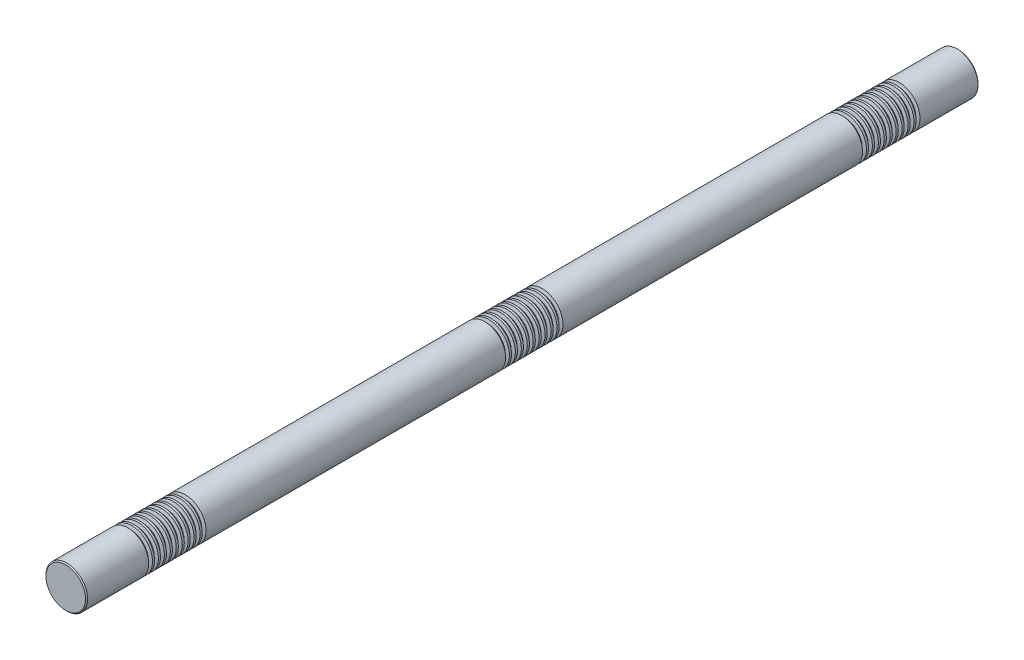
from build123d import *

# Parameters (mm, degrees)
SKETCH1_R           = 35
BOSS_EXTRUDE1_DEPTH = 750
CHAMFER1_SIZE       = 1.75
LPATTERN1_COUNT     = 10
LPATTERN1_PITCH     = 10
LPATTERN2_COUNT     = 3
LPATTERN2_PITCH     = 600


with BuildPart() as part:
    # Sketch1 → Boss-Extrude1 (new, symmetric)
    with BuildSketch(Plane.XY):
        Circle(SKETCH1_R)
    extrude(amount=BOSS_EXTRUDE1_DEPTH, both=True)

    # Chamfer1
    chamfer1_edges = [part.edges().sort_by_distance(p)[0] for p in [
        (-35, 0, -750),
        (-35, 0, 750),
    ]]
    chamfer(chamfer1_edges, length=CHAMFER1_SIZE)

    # Sketch2 → Cut-Revolve1 (revolve, cut)
    with BuildSketch(Plane(origin=(0, 0, 0), x_dir=(0, 0, -1), z_dir=(1, 0, 0)), mode=Mode.PRIVATE) as cut_revolve1_sk:
        Polygon((650.736860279, 35), (644.263139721, 35), (645.736860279, 29.5), (649.263139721, 29.5), align=None)
    cut_revolve1 = revolve(cut_revolve1_sk.sketch.rotate(Axis((0, 0, 750), (0, 0, -1)), 90), axis=Axis((0, 0, 750), (0, 0, -1)), mode=Mode.SUBTRACT)

    # LPattern1: Cut-Revolve1 ×10
    with Locations(*[(0, 0, i * LPATTERN1_PITCH) for i in range(1, LPATTERN1_COUNT)]):
        add(cut_revolve1, mode=Mode.SUBTRACT)

    # LPattern2: Cut-Revolve1 ×3
    with Locations(*[(0, 0, i * LPATTERN2_PITCH) for i in range(1, LPATTERN2_COUNT)]):
        add(cut_revolve1, mode=Mode.SUBTRACT)

    # LPattern2 copy 1 sketch → LPattern2 copy 1 (revolve, cut)
    with BuildSketch(Plane(origin=(0, 0, 610), x_dir=(0, 0, -1), z_dir=(1, 0, 0))):
        Polygon((650.736860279, 35), (644.263139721, 35), (645.736860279, 29.5), (649.263139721, 29.5), align=None)
    revolve(axis=Axis((0, 0, 1360), (0, 0, -1)), mode=Mode.SUBTRACT)

    # LPattern2 copy 2 sketch → LPattern2 copy 2 (revolve, cut)
    with BuildSketch(Plane(origin=(0, 0, 1210), x_dir=(0, 0, -1), z_dir=(1, 0, 0))):
        Polygon((650.736860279, 35), (644.263139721, 35), (645.736860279, 29.5), (649.263139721, 29.5), align=None)
    revolve(axis=Axis((0, 0, 1960), (0, 0, -1)), mode=Mode.SUBTRACT)

    # LPattern2 copy 3 sketch → LPattern2 copy 3 (revolve, cut)
    with BuildSketch(Plane(origin=(0, 0, 620), x_dir=(0, 0, -1), z_dir=(1, 0, 0))):
        Polygon((650.736860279, 35), (644.263139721, 35), (645.736860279, 29.5), (649.263139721, 29.5), align=None)
    revolve(axis=Axis((0, 0, 1370), (0, 0, -1)), mode=Mode.SUBTRACT)

    # LPattern2 copy 4 sketch → LPattern2 copy 4 (revolve, cut)
    with BuildSketch(Plane(origin=(0, 0, 1220), x_dir=(0, 0, -1), z_dir=(1, 0, 0))):
        Polygon((650.736860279, 35), (644.263139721, 35), (645.736860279, 29.5), (649.263139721, 29.5), align=None)
    revolve(axis=Axis((0, 0, 1970), (0, 0, -1)), mode=Mode.SUBTRACT)

    # LPattern2 copy 5 sketch → LPattern2 copy 5 (revolve, cut)
    with BuildSketch(Plane(origin=(0, 0, 630), x_dir=(0, 0, -1), z_dir=(1, 0, 0))):
        Polygon((650.736860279, 35), (644.263139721, 35), (645.736860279, 29.5), (649.263139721, 29.5), align=None)
    revolve(axis=Axis((0, 0, 1380), (0, 0, -1)), mode=Mode.SUBTRACT)

    # LPattern2 copy 6 sketch → LPattern2 copy 6 (revolve, cut)
    with BuildSketch(Plane(origin=(0, 0, 1230), x_dir=(0, 0, -1), z_dir=(1, 0, 0))):
        Polygon((650.736860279, 35), (644.263139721, 35), (645.736860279, 29.5), (649.263139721, 29.5), align=None)
    revolve(axis=Axis((0, 0, 1980), (0, 0, -1)), mode=Mode.SUBTRACT)

    # LPattern2 copy 7 sketch → LPattern2 copy 7 (revolve, cut)
    with BuildSketch(Plane(origin=(0, 0, 640), x_dir=(0, 0, -1), z_dir=(1, 0, 0))):
        Polygon((650.736860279, 35), (644.263139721, 35), (645.736860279, 29.5), (649.263139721, 29.5), align=None)
    revolve(axis=Axis((0, 0, 1390), (0, 0, -1)), mode=Mode.SUBTRACT)

    # LPattern2 copy 8 sketch → LPattern2 copy 8 (revolve, cut)
    with BuildSketch(Plane(origin=(0, 0, 1240), x_dir=(0, 0, -1), z_dir=(1, 0, 0))):
        Polygon((650.736860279, 35), (644.263139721, 35), (645.736860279, 29.5), (649.263139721, 29.5), align=None)
    revolve(axis=Axis((0, 0, 1990), (0, 0, -1)), mode=Mode.SUBTRACT)

    # LPattern2 copy 9 sketch → LPattern2 copy 9 (revolve, cut)
    with BuildSketch(Plane(origin=(0, 0, 650), x_dir=(0, 0, -1), z_dir=(1, 0, 0))):
        Polygon((650.736860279, 35), (644.263139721, 35), (645.736860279, 29.5), (649.263139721, 29.5), align=None)
    revolve(axis=Axis((0, 0, 1400), (0, 0, -1)), mode=Mode.SUBTRACT)

    # LPattern2 copy 10 sketch → LPattern2 copy 10 (revolve, cut)
    with BuildSketch(Plane(origin=(0, 0, 1250), x_dir=(0, 0, -1), z_dir=(1, 0, 0))):
        Polygon((650.736860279, 35), (644.263139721, 35), (645.736860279, 29.5), (649.263139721, 29.5), align=None)
    revolve(axis=Axis((0, 0, 2000), (0, 0, -1)), mode=Mode.SUBTRACT)

    # LPattern2 copy 11 sketch → LPattern2 copy 11 (revolve, cut)
    with BuildSketch(Plane(origin=(0, 0, 660), x_dir=(0, 0, -1), z_dir=(1, 0, 0))):
        Polygon((650.736860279, 35), (644.263139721, 35), (645.736860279, 29.5), (649.263139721, 29.5), align=None)
    revolve(axis=Axis((0, 0, 1410), (0, 0, -1)), mode=Mode.SUBTRACT)

    # LPattern2 copy 12 sketch → LPattern2 copy 12 (revolve, cut)
    with BuildSketch(Plane(origin=(0, 0, 1260), x_dir=(0, 0, -1), z_dir=(1, 0, 0))):
        Polygon((650.736860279, 35), (644.263139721, 35), (645.736860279, 29.5), (649.263139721, 29.5), align=None)
    revolve(axis=Axis((0, 0, 2010), (0, 0, -1)), mode=Mode.SUBTRACT)

    # LPattern2 copy 13 sketch → LPattern2 copy 13 (revolve, cut)
    with BuildSketch(Plane(origin=(0, 0, 670), x_dir=(0, 0, -1), z_dir=(1, 0, 0))):
        Polygon((650.736860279, 35), (644.263139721, 35), (645.736860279, 29.5), (649.263139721, 29.5), align=None)
    revolve(axis=Axis((0, 0, 1420), (0, 0, -1)), mode=Mode.SUBTRACT)

    # LPattern2 copy 14 sketch → LPattern2 copy 14 (revolve, cut)
    with BuildSketch(Plane(origin=(0, 0, 1270), x_dir=(0, 0, -1), z_dir=(1, 0, 0))):
        Polygon((650.736860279, 35), (644.263139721, 35), (645.736860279, 29.5), (649.263139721, 29.5), align=None)
    revolve(axis=Axis((0, 0, 2020), (0, 0, -1)), mode=Mode.SUBTRACT)

    # LPattern2 copy 15 sketch → LPattern2 copy 15 (revolve, cut)
    with BuildSketch(Plane(origin=(0, 0, 680), x_dir=(0, 0, -1), z_dir=(1, 0, 0))):
        Polygon((650.736860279, 35), (644.263139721, 35), (645.736860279, 29.5), (649.263139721, 29.5), align=None)
    revolve(axis=Axis((0, 0, 1430), (0, 0, -1)), mode=Mode.SUBTRACT)

    # LPattern2 copy 16 sketch → LPattern2 copy 16 (revolve, cut)
    with BuildSketch(Plane(origin=(0, 0, 1280), x_dir=(0, 0, -1), z_dir=(1, 0, 0))):
        Polygon((650.736860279, 35), (644.263139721, 35), (645.736860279, 29.5), (649.263139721, 29.5), align=None)
    revolve(axis=Axis((0, 0, 2030), (0, 0, -1)), mode=Mode.SUBTRACT)

    # LPattern2 copy 17 sketch → LPattern2 copy 17 (revolve, cut)
    with BuildSketch(Plane(origin=(0, 0, 690), x_dir=(0, 0, -1), z_dir=(1, 0, 0))):
        Polygon((650.736860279, 35), (644.263139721, 35), (645.736860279, 29.5), (649.263139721, 29.5), align=None)
    revolve(axis=Axis((0, 0, 1440), (0, 0, -1)), mode=Mode.SUBTRACT)

    # LPattern2 copy 18 sketch → LPattern2 copy 18 (revolve, cut)
    with BuildSketch(Plane(origin=(0, 0, 1290), x_dir=(0, 0, -1), z_dir=(1, 0, 0))):
        Polygon((650.736860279, 35), (644.263139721, 35), (645.736860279, 29.5), (649.263139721, 29.5), align=None)
    revolve(axis=Axis((0, 0, 2040), (0, 0, -1)), mode=Mode.SUBTRACT)


solid = part.part
